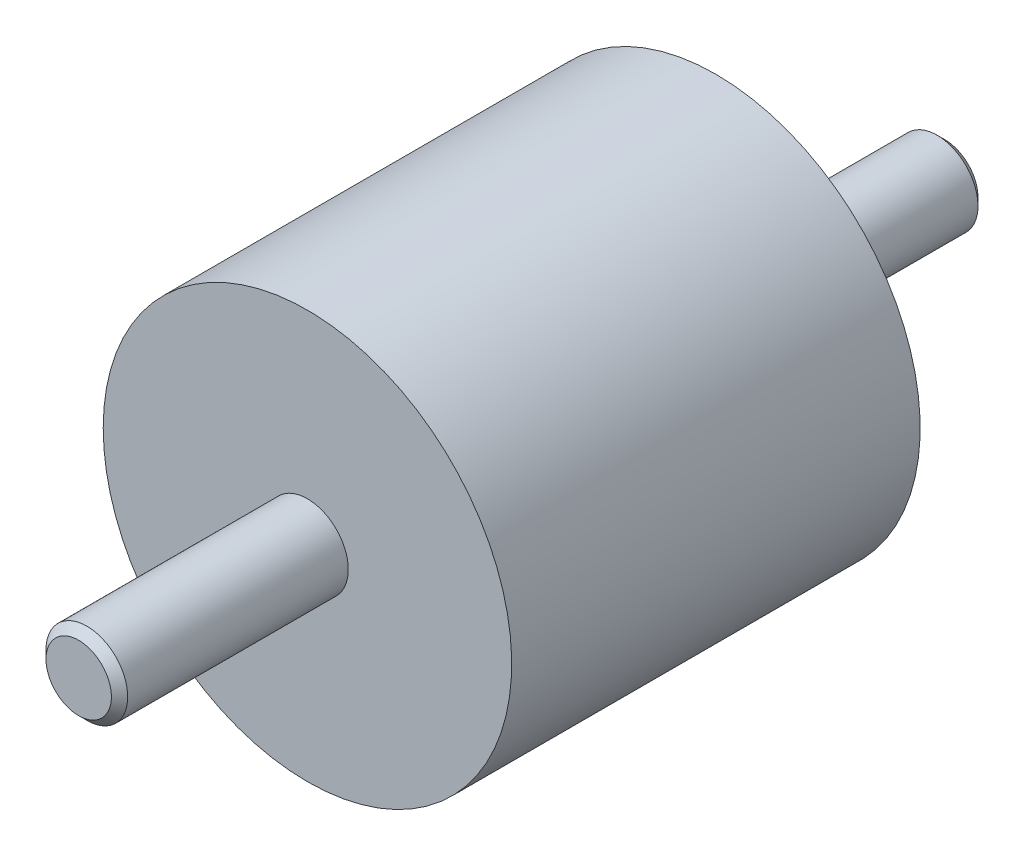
ISO-10303-21;
HEADER;
FILE_DESCRIPTION(('STEP AP214'),'2;1');
FILE_NAME('part.step','',(''),(''),'','','');
FILE_SCHEMA(('AUTOMOTIVE_DESIGN { 1 0 10303 214 1 1 1 1 }'));
ENDSEC;
DATA;
#1=APPLICATION_CONTEXT('core data for automotive mechanical design processes');
#2=APPLICATION_PROTOCOL_DEFINITION('international standard','automotive_design',2000,#1);
#3=PRODUCT_CONTEXT('',#1,'mechanical');
#4=PRODUCT('Part','Part','',(#3));
#5=PRODUCT_RELATED_PRODUCT_CATEGORY('part','',(#4));
#6=PRODUCT_DEFINITION_FORMATION('','',#4);
#7=PRODUCT_DEFINITION_CONTEXT('part definition',#1,'design');
#8=PRODUCT_DEFINITION('design','',#6,#7);
#9=PRODUCT_DEFINITION_SHAPE('','',#8);
#10=(LENGTH_UNIT() NAMED_UNIT(*) SI_UNIT(.MILLI.,.METRE.));
#11=(NAMED_UNIT(*) PLANE_ANGLE_UNIT() SI_UNIT($,.RADIAN.));
#12=(NAMED_UNIT(*) SI_UNIT($,.STERADIAN.) SOLID_ANGLE_UNIT());
#13=UNCERTAINTY_MEASURE_WITH_UNIT(LENGTH_MEASURE(1.E-05),#10,'distance_accuracy_value','');
#14=(GEOMETRIC_REPRESENTATION_CONTEXT(3) GLOBAL_UNCERTAINTY_ASSIGNED_CONTEXT((#13)) GLOBAL_UNIT_ASSIGNED_CONTEXT((#10,
#11,#12)) REPRESENTATION_CONTEXT('',''));
#15=CARTESIAN_POINT('',(0.,0.,0.));
#16=DIRECTION('',(0.,0.,1.));
#17=DIRECTION('',(1.,0.,0.));
#18=AXIS2_PLACEMENT_3D('',#15,#16,#17);
#19=CARTESIAN_POINT('',(0.,0.,0.66666666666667));
#20=DIRECTION('',(0.,0.,1.));
#21=DIRECTION('',(0.,-1.,0.));
#22=AXIS2_PLACEMENT_3D('',#19,#20,#21);
#23=CYLINDRICAL_SURFACE('',#22,25.);
#24=CARTESIAN_POINT('',(0.,0.,0.));
#25=DIRECTION('',(0.,0.,1.));
#26=DIRECTION('',(0.,-1.,0.));
#27=AXIS2_PLACEMENT_3D('',#24,#25,#26);
#28=CIRCLE('',#27,25.);
#29=CARTESIAN_POINT('',(0.,-25.,0.));
#30=VERTEX_POINT('',#29);
#31=EDGE_CURVE('E18',#30,#30,#28,.T.);
#32=ORIENTED_EDGE('',*,*,#31,.T.);
#33=EDGE_LOOP('',(#32));
#34=FACE_BOUND('',#33,.T.);
#35=CARTESIAN_POINT('',(0.,0.,50.));
#36=DIRECTION('',(0.,0.,-1.));
#37=DIRECTION('',(-1.,0.,0.));
#38=AXIS2_PLACEMENT_3D('',#35,#36,#37);
#39=CIRCLE('',#38,25.);
#40=CARTESIAN_POINT('',(-25.,0.,50.));
#41=VERTEX_POINT('',#40);
#42=EDGE_CURVE('E31',#41,#41,#39,.T.);
#43=ORIENTED_EDGE('',*,*,#42,.T.);
#44=EDGE_LOOP('',(#43));
#45=FACE_BOUND('',#44,.T.);
#46=ADVANCED_FACE('F12',(#34,#45),#23,.T.);
#47=CARTESIAN_POINT('',(25.,0.,0.));
#48=DIRECTION('',(0.,0.,-1.));
#49=DIRECTION('',(0.,1.,0.));
#50=AXIS2_PLACEMENT_3D('',#47,#48,#49);
#51=PLANE('',#50);
#52=CARTESIAN_POINT('',(0.,0.,0.));
#53=DIRECTION('',(0.,0.,-1.));
#54=DIRECTION('',(0.,1.,0.));
#55=AXIS2_PLACEMENT_3D('',#52,#53,#54);
#56=CIRCLE('',#55,5.);
#57=CARTESIAN_POINT('',(0.,5.,0.));
#58=VERTEX_POINT('',#57);
#59=EDGE_CURVE('E8',#58,#58,#56,.T.);
#60=ORIENTED_EDGE('',*,*,#59,.F.);
#61=EDGE_LOOP('',(#60));
#62=FACE_BOUND('',#61,.T.);
#63=ORIENTED_EDGE('',*,*,#31,.F.);
#64=EDGE_LOOP('',(#63));
#65=FACE_BOUND('',#64,.T.);
#66=ADVANCED_FACE('F57',(#62,#65),#51,.T.);
#67=CARTESIAN_POINT('',(0.,0.,-28.));
#68=DIRECTION('',(0.,0.,1.));
#69=DIRECTION('',(0.,-1.,0.));
#70=AXIS2_PLACEMENT_3D('',#67,#68,#69);
#71=CYLINDRICAL_SURFACE('',#70,5.);
#72=CARTESIAN_POINT('',(0.,0.,-27.08));
#73=DIRECTION('',(0.,0.,1.));
#74=DIRECTION('',(0.,-1.,0.));
#75=AXIS2_PLACEMENT_3D('',#72,#73,#74);
#76=CIRCLE('',#75,5.);
#77=CARTESIAN_POINT('',(0.,-5.,-27.08));
#78=VERTEX_POINT('',#77);
#79=EDGE_CURVE('E22',#78,#78,#76,.T.);
#80=ORIENTED_EDGE('',*,*,#79,.T.);
#81=EDGE_LOOP('',(#80));
#82=FACE_BOUND('',#81,.T.);
#83=ORIENTED_EDGE('',*,*,#59,.T.);
#84=EDGE_LOOP('',(#83));
#85=FACE_BOUND('',#84,.T.);
#86=ADVANCED_FACE('F61',(#82,#85),#71,.T.);
#87=CARTESIAN_POINT('',(0.,0.,-27.08));
#88=DIRECTION('',(0.,0.,1.));
#89=DIRECTION('',(0.,-1.,0.));
#90=AXIS2_PLACEMENT_3D('',#87,#88,#89);
#91=CONICAL_SURFACE('',#90,5.,0.785398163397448);
#92=CARTESIAN_POINT('',(0.,0.,-28.));
#93=DIRECTION('',(0.,0.,1.));
#94=DIRECTION('',(0.,-1.,0.));
#95=AXIS2_PLACEMENT_3D('',#92,#93,#94);
#96=CIRCLE('',#95,4.08);
#97=CARTESIAN_POINT('',(0.,-4.08,-28.));
#98=VERTEX_POINT('',#97);
#99=EDGE_CURVE('E26',#98,#98,#96,.T.);
#100=ORIENTED_EDGE('',*,*,#99,.T.);
#101=EDGE_LOOP('',(#100));
#102=FACE_BOUND('',#101,.T.);
#103=ORIENTED_EDGE('',*,*,#79,.F.);
#104=EDGE_LOOP('',(#103));
#105=FACE_BOUND('',#104,.T.);
#106=ADVANCED_FACE('F77',(#102,#105),#91,.T.);
#107=CARTESIAN_POINT('',(4.08,0.,-28.));
#108=DIRECTION('',(0.,0.,-1.));
#109=DIRECTION('',(0.,1.,0.));
#110=AXIS2_PLACEMENT_3D('',#107,#108,#109);
#111=PLANE('',#110);
#112=ORIENTED_EDGE('',*,*,#99,.F.);
#113=EDGE_LOOP('',(#112));
#114=FACE_BOUND('',#113,.T.);
#115=ADVANCED_FACE('F68',(#114),#111,.T.);
#116=CARTESIAN_POINT('',(0.,25.,50.));
#117=DIRECTION('',(0.,0.,1.));
#118=DIRECTION('',(1.,0.,0.));
#119=AXIS2_PLACEMENT_3D('',#116,#117,#118);
#120=PLANE('',#119);
#121=CARTESIAN_POINT('',(0.,0.,50.));
#122=DIRECTION('',(0.,0.,-1.));
#123=DIRECTION('',(-1.,0.,0.));
#124=AXIS2_PLACEMENT_3D('',#121,#122,#123);
#125=CIRCLE('',#124,5.);
#126=CARTESIAN_POINT('',(-5.,0.,50.));
#127=VERTEX_POINT('',#126);
#128=EDGE_CURVE('E34',#127,#127,#125,.T.);
#129=ORIENTED_EDGE('',*,*,#128,.T.);
#130=EDGE_LOOP('',(#129));
#131=FACE_BOUND('',#130,.T.);
#132=ORIENTED_EDGE('',*,*,#42,.F.);
#133=EDGE_LOOP('',(#132));
#134=FACE_BOUND('',#133,.T.);
#135=ADVANCED_FACE('F66',(#131,#134),#120,.T.);
#136=CARTESIAN_POINT('',(0.,0.,-36.9565049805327));
#137=DIRECTION('',(0.,0.,-1.));
#138=DIRECTION('',(-1.,0.,0.));
#139=AXIS2_PLACEMENT_3D('',#136,#137,#138);
#140=CYLINDRICAL_SURFACE('',#139,5.);
#141=CARTESIAN_POINT('',(0.,0.,77.0023270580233));
#142=DIRECTION('',(0.,0.,-1.));
#143=DIRECTION('',(-1.,0.,0.));
#144=AXIS2_PLACEMENT_3D('',#141,#142,#143);
#145=CIRCLE('',#144,5.);
#146=CARTESIAN_POINT('',(-5.,0.,77.0023270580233));
#147=VERTEX_POINT('',#146);
#148=EDGE_CURVE('E37',#147,#147,#145,.T.);
#149=ORIENTED_EDGE('',*,*,#148,.T.);
#150=EDGE_LOOP('',(#149));
#151=FACE_BOUND('',#150,.T.);
#152=ORIENTED_EDGE('',*,*,#128,.F.);
#153=EDGE_LOOP('',(#152));
#154=FACE_BOUND('',#153,.T.);
#155=ADVANCED_FACE('F54',(#151,#154),#140,.T.);
#156=CARTESIAN_POINT('',(0.,0.,77.0023270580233));
#157=DIRECTION('',(0.,0.,-1.));
#158=DIRECTION('',(-1.,0.,0.));
#159=AXIS2_PLACEMENT_3D('',#156,#157,#158);
#160=CONICAL_SURFACE('',#159,5.,0.785398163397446);
#161=CARTESIAN_POINT('',(0.,0.,78.));
#162=DIRECTION('',(0.,0.,-1.));
#163=DIRECTION('',(-1.,0.,0.));
#164=AXIS2_PLACEMENT_3D('',#161,#162,#163);
#165=CIRCLE('',#164,4.00232705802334);
#166=CARTESIAN_POINT('',(-4.00232705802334,0.,78.));
#167=VERTEX_POINT('',#166);
#168=EDGE_CURVE('E40',#167,#167,#165,.T.);
#169=ORIENTED_EDGE('',*,*,#168,.T.);
#170=EDGE_LOOP('',(#169));
#171=FACE_BOUND('',#170,.T.);
#172=ORIENTED_EDGE('',*,*,#148,.F.);
#173=EDGE_LOOP('',(#172));
#174=FACE_BOUND('',#173,.T.);
#175=ADVANCED_FACE('F44',(#171,#174),#160,.T.);
#176=CARTESIAN_POINT('',(0.,4.00232705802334,78.));
#177=DIRECTION('',(0.,0.,1.));
#178=DIRECTION('',(1.,0.,0.));
#179=AXIS2_PLACEMENT_3D('',#176,#177,#178);
#180=PLANE('',#179);
#181=ORIENTED_EDGE('',*,*,#168,.F.);
#182=EDGE_LOOP('',(#181));
#183=FACE_BOUND('',#182,.T.);
#184=ADVANCED_FACE('F47',(#183),#180,.T.);
#185=CLOSED_SHELL('',(#46,#66,#86,#106,#115,#135,#155,#175,#184));
#186=MANIFOLD_SOLID_BREP('B1',#185);
#187=ADVANCED_BREP_SHAPE_REPRESENTATION('',(#18,#186),#14);
#188=SHAPE_DEFINITION_REPRESENTATION(#9,#187);
ENDSEC;
END-ISO-10303-21;
